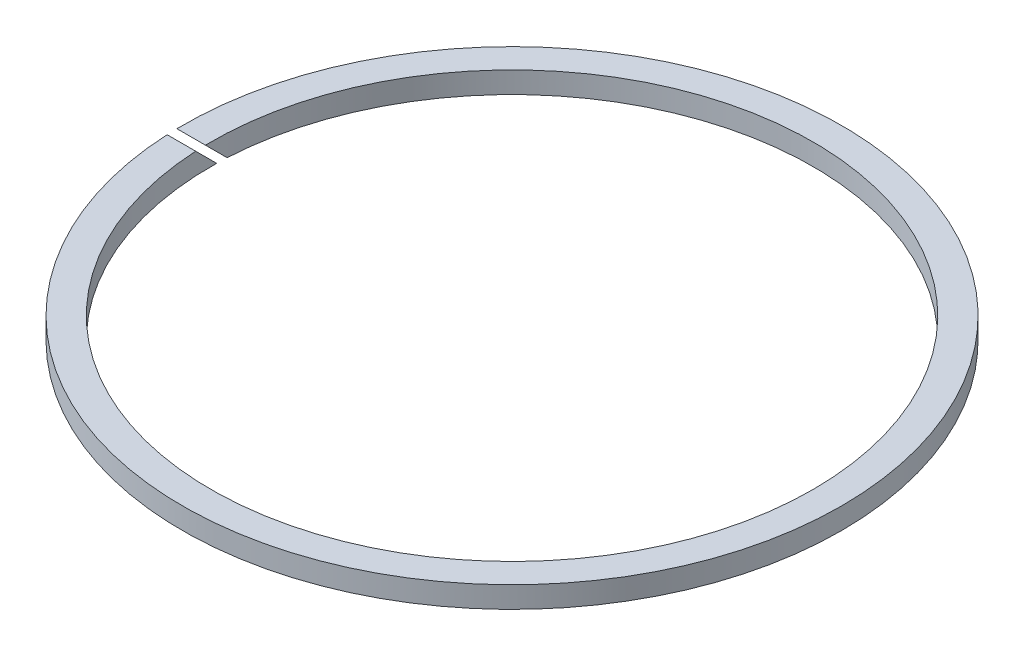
from build123d import *

# Parameters (mm, degrees)
SKETCH1_R               = 46.25
SKETCH1_R_2             = 42.25
BOSS_EXTRUDE1_DEPTH     = 1.5
CUT_EXTRUDE1_REACH      = 67.425
CUT_EXTRUDE1_END_RADIUS = 46.25


with BuildPart() as part:
    # Sketch1 → Boss-Extrude1 (new, symmetric)
    with BuildSketch(Plane(origin=(0, 0, 0), x_dir=(1, 0, 0), z_dir=(0, 1, 0))):
        with Locations(Location((0, 0, 0), (0, 0, 270))):
            Circle(SKETCH1_R)
        with Locations(Location((0, 0, 0), (0, 0, 270))):
            Circle(SKETCH1_R_2, mode=Mode.SUBTRACT)
    extrude(amount=BOSS_EXTRUDE1_DEPTH, both=True)

    # Cut-Extrude1: up to this cylinder (the profile starts inside it)
    cut_extrude1_end = Plane(origin=(0, 0, 0), z_dir=(0, -1, 0)) * Cylinder(CUT_EXTRUDE1_END_RADIUS, 228.35, mode=Mode.PRIVATE)
    # Sketch2 → Cut-Extrude1 (cut, up to the surface)
    with BuildSketch(Plane(origin=(0, 0, 0), x_dir=(0, 0, -1), z_dir=(1, 0, 0)), mode=Mode.PRIVATE) as cut_extrude1_sk1:
        Polygon((-3.672911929, 4.38001871), (4.38001871, -3.672911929), (3.672911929, -4.38001871), (-4.38001871, 3.672911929), align=None)
    cut_extrude1_tool1 = extrude(cut_extrude1_sk1.sketch, amount=-CUT_EXTRUDE1_REACH, mode=Mode.PRIVATE) & cut_extrude1_end
    add(cut_extrude1_tool1.solids().sort_by_distance((0, 0, 0))[0], mode=Mode.SUBTRACT)


solid = part.part
